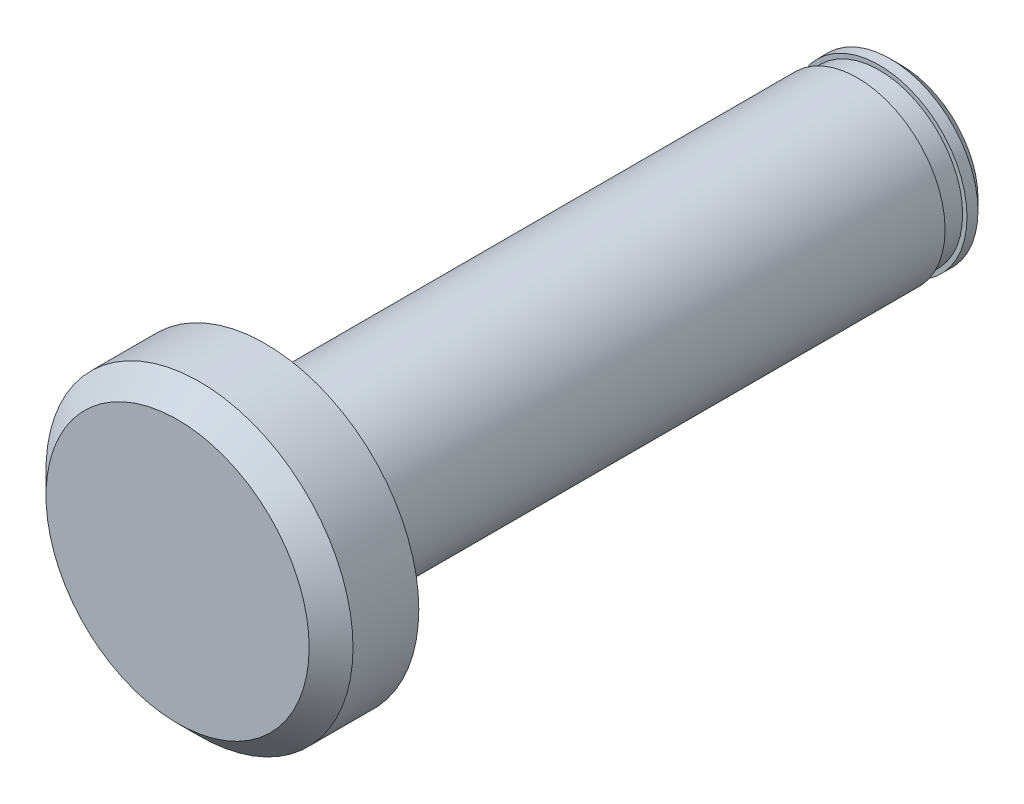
ISO-10303-21;
HEADER;
FILE_DESCRIPTION(('STEP AP214'),'2;1');
FILE_NAME('part.step','',(''),(''),'','','');
FILE_SCHEMA(('AUTOMOTIVE_DESIGN { 1 0 10303 214 1 1 1 1 }'));
ENDSEC;
DATA;
#1=APPLICATION_CONTEXT('core data for automotive mechanical design processes');
#2=APPLICATION_PROTOCOL_DEFINITION('international standard','automotive_design',2000,#1);
#3=PRODUCT_CONTEXT('',#1,'mechanical');
#4=PRODUCT('Part','Part','',(#3));
#5=PRODUCT_RELATED_PRODUCT_CATEGORY('part','',(#4));
#6=PRODUCT_DEFINITION_FORMATION('','',#4);
#7=PRODUCT_DEFINITION_CONTEXT('part definition',#1,'design');
#8=PRODUCT_DEFINITION('design','',#6,#7);
#9=PRODUCT_DEFINITION_SHAPE('','',#8);
#10=(LENGTH_UNIT() NAMED_UNIT(*) SI_UNIT(.MILLI.,.METRE.));
#11=(NAMED_UNIT(*) PLANE_ANGLE_UNIT() SI_UNIT($,.RADIAN.));
#12=(NAMED_UNIT(*) SI_UNIT($,.STERADIAN.) SOLID_ANGLE_UNIT());
#13=UNCERTAINTY_MEASURE_WITH_UNIT(LENGTH_MEASURE(1.E-05),#10,'distance_accuracy_value','');
#14=(GEOMETRIC_REPRESENTATION_CONTEXT(3) GLOBAL_UNCERTAINTY_ASSIGNED_CONTEXT((#13)) GLOBAL_UNIT_ASSIGNED_CONTEXT((#10,
#11,#12)) REPRESENTATION_CONTEXT('',''));
#15=CARTESIAN_POINT('',(0.,0.,0.));
#16=DIRECTION('',(0.,0.,1.));
#17=DIRECTION('',(1.,0.,0.));
#18=AXIS2_PLACEMENT_3D('',#15,#16,#17);
#19=CARTESIAN_POINT('',(-8.48858090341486,0.,38.9511504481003));
#20=DIRECTION('',(0.,0.,-1.));
#21=DIRECTION('',(-1.,0.,0.));
#22=AXIS2_PLACEMENT_3D('',#19,#20,#21);
#23=CONICAL_SURFACE('',#22,6.00000000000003,0.785398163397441);
#24=CARTESIAN_POINT('',(-8.48858090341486,0.,37.9511504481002));
#25=DIRECTION('',(0.,0.,1.));
#26=DIRECTION('',(1.,0.,0.));
#27=AXIS2_PLACEMENT_3D('',#24,#25,#26);
#28=CIRCLE('',#27,7.00000000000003);
#29=CARTESIAN_POINT('',(-1.48858090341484,0.,37.9511504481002));
#30=VERTEX_POINT('',#29);
#31=EDGE_CURVE('E69',#30,#30,#28,.T.);
#32=ORIENTED_EDGE('',*,*,#31,.T.);
#33=EDGE_LOOP('',(#32));
#34=FACE_BOUND('',#33,.T.);
#35=CARTESIAN_POINT('',(-8.48858090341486,0.,38.9511504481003));
#36=DIRECTION('',(0.,0.,1.));
#37=DIRECTION('',(1.,0.,0.));
#38=AXIS2_PLACEMENT_3D('',#35,#36,#37);
#39=CIRCLE('',#38,6.00000000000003);
#40=CARTESIAN_POINT('',(-2.48858090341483,0.,38.9511504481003));
#41=VERTEX_POINT('',#40);
#42=EDGE_CURVE('E10',#41,#41,#39,.T.);
#43=ORIENTED_EDGE('',*,*,#42,.F.);
#44=EDGE_LOOP('',(#43));
#45=FACE_BOUND('',#44,.T.);
#46=ADVANCED_FACE('F35',(#34,#45),#23,.T.);
#47=CARTESIAN_POINT('',(-14.4885809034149,0.,38.9511504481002));
#48=DIRECTION('',(0.,0.,-1.));
#49=DIRECTION('',(-1.,0.,0.));
#50=AXIS2_PLACEMENT_3D('',#47,#48,#49);
#51=PLANE('',#50);
#52=ORIENTED_EDGE('',*,*,#42,.T.);
#53=EDGE_LOOP('',(#52));
#54=FACE_BOUND('',#53,.T.);
#55=ADVANCED_FACE('F105',(#54),#51,.F.);
#56=CARTESIAN_POINT('',(-8.48858090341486,0.,5.95115044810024));
#57=DIRECTION('',(0.,0.,1.));
#58=DIRECTION('',(1.,0.,0.));
#59=AXIS2_PLACEMENT_3D('',#56,#57,#58);
#60=PLANE('',#59);
#61=CARTESIAN_POINT('',(-8.48858090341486,0.,5.95115044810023));
#62=DIRECTION('',(0.,0.,1.));
#63=DIRECTION('',(1.,0.,0.));
#64=AXIS2_PLACEMENT_3D('',#61,#62,#63);
#65=CIRCLE('',#64,3.50000000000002);
#66=CARTESIAN_POINT('',(-4.98858090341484,0.,5.95115044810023));
#67=VERTEX_POINT('',#66);
#68=EDGE_CURVE('E41',#67,#67,#65,.T.);
#69=ORIENTED_EDGE('',*,*,#68,.F.);
#70=EDGE_LOOP('',(#69));
#71=FACE_BOUND('',#70,.T.);
#72=ADVANCED_FACE('F109',(#71),#60,.F.);
#73=CARTESIAN_POINT('',(-8.48858090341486,0.,5.95115044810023));
#74=DIRECTION('',(0.,0.,1.));
#75=DIRECTION('',(1.,0.,0.));
#76=AXIS2_PLACEMENT_3D('',#73,#74,#75);
#77=CONICAL_SURFACE('',#76,3.50000000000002,0.785398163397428);
#78=CARTESIAN_POINT('',(-8.48858090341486,0.,6.45115044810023));
#79=DIRECTION('',(0.,0.,1.));
#80=DIRECTION('',(1.,0.,0.));
#81=AXIS2_PLACEMENT_3D('',#78,#79,#80);
#82=CIRCLE('',#81,4.);
#83=CARTESIAN_POINT('',(-4.48858090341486,0.,6.45115044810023));
#84=VERTEX_POINT('',#83);
#85=EDGE_CURVE('E45',#84,#84,#82,.T.);
#86=ORIENTED_EDGE('',*,*,#85,.F.);
#87=EDGE_LOOP('',(#86));
#88=FACE_BOUND('',#87,.T.);
#89=ORIENTED_EDGE('',*,*,#68,.T.);
#90=EDGE_LOOP('',(#89));
#91=FACE_BOUND('',#90,.T.);
#92=ADVANCED_FACE('F113',(#88,#91),#77,.T.);
#93=CARTESIAN_POINT('',(-8.48858090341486,0.,56.2933316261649));
#94=DIRECTION('',(0.,0.,1.));
#95=DIRECTION('',(1.,0.,0.));
#96=AXIS2_PLACEMENT_3D('',#93,#94,#95);
#97=CYLINDRICAL_SURFACE('',#96,4.00000000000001);
#98=CARTESIAN_POINT('',(-8.48858090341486,0.,6.95115044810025));
#99=DIRECTION('',(0.,0.,1.));
#100=DIRECTION('',(1.,0.,0.));
#101=AXIS2_PLACEMENT_3D('',#98,#99,#100);
#102=CIRCLE('',#101,4.00000000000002);
#103=CARTESIAN_POINT('',(-4.48858090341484,0.,6.95115044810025));
#104=VERTEX_POINT('',#103);
#105=EDGE_CURVE('E49',#104,#104,#102,.T.);
#106=ORIENTED_EDGE('',*,*,#105,.F.);
#107=EDGE_LOOP('',(#106));
#108=FACE_BOUND('',#107,.T.);
#109=ORIENTED_EDGE('',*,*,#85,.T.);
#110=EDGE_LOOP('',(#109));
#111=FACE_BOUND('',#110,.T.);
#112=ADVANCED_FACE('F119',(#108,#111),#97,.T.);
#113=CARTESIAN_POINT('',(-12.4885809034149,0.,6.95115044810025));
#114=DIRECTION('',(0.,0.,-1.));
#115=DIRECTION('',(-1.,0.,0.));
#116=AXIS2_PLACEMENT_3D('',#113,#114,#115);
#117=PLANE('',#116);
#118=CARTESIAN_POINT('',(-8.48858090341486,0.,6.95115044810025));
#119=DIRECTION('',(0.,0.,1.));
#120=DIRECTION('',(1.,0.,0.));
#121=AXIS2_PLACEMENT_3D('',#118,#119,#120);
#122=CIRCLE('',#121,3.80000000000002);
#123=CARTESIAN_POINT('',(-4.68858090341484,0.,6.95115044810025));
#124=VERTEX_POINT('',#123);
#125=EDGE_CURVE('E54',#124,#124,#122,.T.);
#126=ORIENTED_EDGE('',*,*,#125,.F.);
#127=EDGE_LOOP('',(#126));
#128=FACE_BOUND('',#127,.T.);
#129=ORIENTED_EDGE('',*,*,#105,.T.);
#130=EDGE_LOOP('',(#129));
#131=FACE_BOUND('',#130,.T.);
#132=ADVANCED_FACE('F101',(#128,#131),#117,.F.);
#133=CARTESIAN_POINT('',(-8.48858090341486,0.,56.2933316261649));
#134=DIRECTION('',(0.,0.,1.));
#135=DIRECTION('',(1.,0.,0.));
#136=AXIS2_PLACEMENT_3D('',#133,#134,#135);
#137=CYLINDRICAL_SURFACE('',#136,3.80000000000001);
#138=CARTESIAN_POINT('',(-8.48858090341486,0.,7.95115044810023));
#139=DIRECTION('',(0.,0.,1.));
#140=DIRECTION('',(1.,0.,0.));
#141=AXIS2_PLACEMENT_3D('',#138,#139,#140);
#142=CIRCLE('',#141,3.8);
#143=CARTESIAN_POINT('',(-4.68858090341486,0.,7.95115044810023));
#144=VERTEX_POINT('',#143);
#145=EDGE_CURVE('E57',#144,#144,#142,.T.);
#146=ORIENTED_EDGE('',*,*,#145,.F.);
#147=EDGE_LOOP('',(#146));
#148=FACE_BOUND('',#147,.T.);
#149=ORIENTED_EDGE('',*,*,#125,.T.);
#150=EDGE_LOOP('',(#149));
#151=FACE_BOUND('',#150,.T.);
#152=ADVANCED_FACE('F95',(#148,#151),#137,.T.);
#153=CARTESIAN_POINT('',(-12.4885809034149,0.,7.95115044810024));
#154=DIRECTION('',(0.,0.,-1.));
#155=DIRECTION('',(-1.,0.,0.));
#156=AXIS2_PLACEMENT_3D('',#153,#154,#155);
#157=PLANE('',#156);
#158=ORIENTED_EDGE('',*,*,#145,.T.);
#159=EDGE_LOOP('',(#158));
#160=FACE_BOUND('',#159,.T.);
#161=CARTESIAN_POINT('',(-8.48858090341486,0.,7.95115044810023));
#162=DIRECTION('',(0.,0.,1.));
#163=DIRECTION('',(1.,0.,0.));
#164=AXIS2_PLACEMENT_3D('',#161,#162,#163);
#165=CIRCLE('',#164,4.);
#166=CARTESIAN_POINT('',(-4.48858090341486,0.,7.95115044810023));
#167=VERTEX_POINT('',#166);
#168=EDGE_CURVE('E60',#167,#167,#165,.T.);
#169=ORIENTED_EDGE('',*,*,#168,.F.);
#170=EDGE_LOOP('',(#169));
#171=FACE_BOUND('',#170,.T.);
#172=ADVANCED_FACE('F90',(#160,#171),#157,.T.);
#173=CARTESIAN_POINT('',(-8.48858090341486,0.,56.2933316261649));
#174=DIRECTION('',(0.,0.,1.));
#175=DIRECTION('',(1.,0.,0.));
#176=AXIS2_PLACEMENT_3D('',#173,#174,#175);
#177=CYLINDRICAL_SURFACE('',#176,4.);
#178=CARTESIAN_POINT('',(-8.48858090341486,0.,34.9511504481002));
#179=DIRECTION('',(0.,0.,1.));
#180=DIRECTION('',(1.,0.,0.));
#181=AXIS2_PLACEMENT_3D('',#178,#179,#180);
#182=CIRCLE('',#181,4.);
#183=CARTESIAN_POINT('',(-4.48858090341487,0.,34.9511504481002));
#184=VERTEX_POINT('',#183);
#185=EDGE_CURVE('E63',#184,#184,#182,.T.);
#186=ORIENTED_EDGE('',*,*,#185,.F.);
#187=EDGE_LOOP('',(#186));
#188=FACE_BOUND('',#187,.T.);
#189=ORIENTED_EDGE('',*,*,#168,.T.);
#190=EDGE_LOOP('',(#189));
#191=FACE_BOUND('',#190,.T.);
#192=ADVANCED_FACE('F84',(#188,#191),#177,.T.);
#193=CARTESIAN_POINT('',(-12.4885809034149,0.,34.9511504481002));
#194=DIRECTION('',(0.,0.,1.));
#195=DIRECTION('',(1.,0.,0.));
#196=AXIS2_PLACEMENT_3D('',#193,#194,#195);
#197=PLANE('',#196);
#198=CARTESIAN_POINT('',(-8.48858090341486,0.,34.9511504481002));
#199=DIRECTION('',(0.,0.,1.));
#200=DIRECTION('',(1.,0.,0.));
#201=AXIS2_PLACEMENT_3D('',#198,#199,#200);
#202=CIRCLE('',#201,7.);
#203=CARTESIAN_POINT('',(-1.48858090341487,0.,34.9511504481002));
#204=VERTEX_POINT('',#203);
#205=EDGE_CURVE('E66',#204,#204,#202,.T.);
#206=ORIENTED_EDGE('',*,*,#205,.F.);
#207=EDGE_LOOP('',(#206));
#208=FACE_BOUND('',#207,.T.);
#209=ORIENTED_EDGE('',*,*,#185,.T.);
#210=EDGE_LOOP('',(#209));
#211=FACE_BOUND('',#210,.T.);
#212=ADVANCED_FACE('F78',(#208,#211),#197,.F.);
#213=CARTESIAN_POINT('',(-8.48858090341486,0.,56.2933316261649));
#214=DIRECTION('',(0.,0.,1.));
#215=DIRECTION('',(1.,0.,0.));
#216=AXIS2_PLACEMENT_3D('',#213,#214,#215);
#217=CYLINDRICAL_SURFACE('',#216,7.00000000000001);
#218=ORIENTED_EDGE('',*,*,#31,.F.);
#219=EDGE_LOOP('',(#218));
#220=FACE_BOUND('',#219,.T.);
#221=ORIENTED_EDGE('',*,*,#205,.T.);
#222=EDGE_LOOP('',(#221));
#223=FACE_BOUND('',#222,.T.);
#224=ADVANCED_FACE('F75',(#220,#223),#217,.T.);
#225=CLOSED_SHELL('',(#46,#55,#72,#92,#112,#132,#152,#172,#192,#212,#224));
#226=MANIFOLD_SOLID_BREP('B2',#225);
#227=ADVANCED_BREP_SHAPE_REPRESENTATION('',(#18,#226),#14);
#228=SHAPE_DEFINITION_REPRESENTATION(#9,#227);
ENDSEC;
END-ISO-10303-21;
